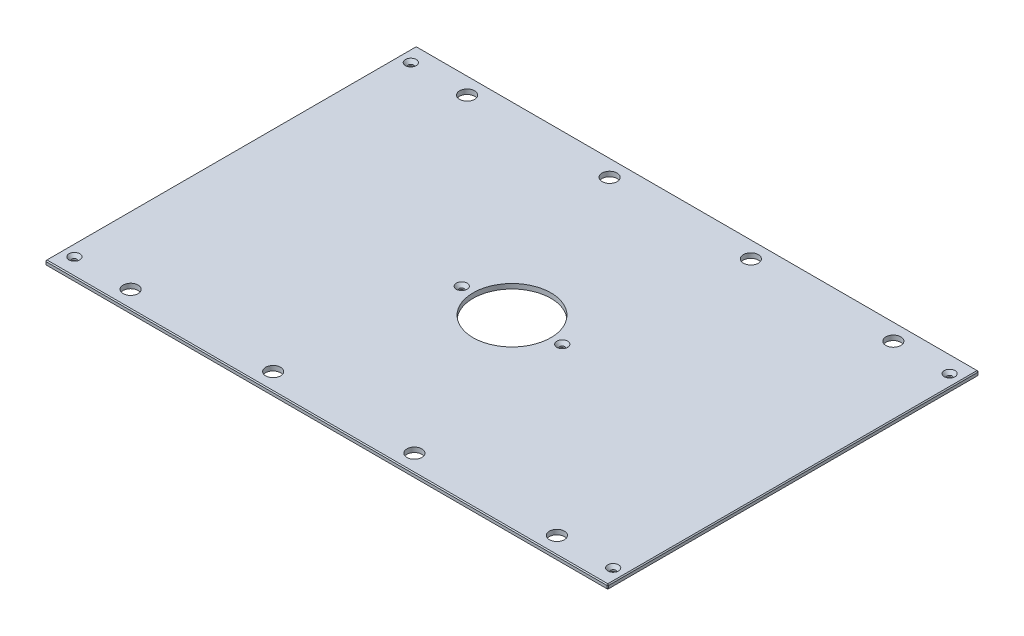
ISO-10303-21;
HEADER;
FILE_DESCRIPTION(('STEP AP214'),'2;1');
FILE_NAME('part.step','',(''),(''),'','','');
FILE_SCHEMA(('AUTOMOTIVE_DESIGN { 1 0 10303 214 1 1 1 1 }'));
ENDSEC;
DATA;
#1=APPLICATION_CONTEXT('core data for automotive mechanical design processes');
#2=APPLICATION_PROTOCOL_DEFINITION('international standard','automotive_design',2000,#1);
#3=PRODUCT_CONTEXT('',#1,'mechanical');
#4=PRODUCT('Part','Part','',(#3));
#5=PRODUCT_RELATED_PRODUCT_CATEGORY('part','',(#4));
#6=PRODUCT_DEFINITION_FORMATION('','',#4);
#7=PRODUCT_DEFINITION_CONTEXT('part definition',#1,'design');
#8=PRODUCT_DEFINITION('design','',#6,#7);
#9=PRODUCT_DEFINITION_SHAPE('','',#8);
#10=(LENGTH_UNIT() NAMED_UNIT(*) SI_UNIT(.MILLI.,.METRE.));
#11=(NAMED_UNIT(*) PLANE_ANGLE_UNIT() SI_UNIT($,.RADIAN.));
#12=(NAMED_UNIT(*) SI_UNIT($,.STERADIAN.) SOLID_ANGLE_UNIT());
#13=UNCERTAINTY_MEASURE_WITH_UNIT(LENGTH_MEASURE(1.E-05),#10,'distance_accuracy_value','');
#14=(GEOMETRIC_REPRESENTATION_CONTEXT(3) GLOBAL_UNCERTAINTY_ASSIGNED_CONTEXT((#13)) GLOBAL_UNIT_ASSIGNED_CONTEXT((#10,
#11,#12)) REPRESENTATION_CONTEXT('',''));
#15=CARTESIAN_POINT('',(0.,0.,0.));
#16=DIRECTION('',(0.,0.,1.));
#17=DIRECTION('',(1.,0.,0.));
#18=AXIS2_PLACEMENT_3D('',#15,#16,#17);
#19=CARTESIAN_POINT('',(-373.0625,6.35,-246.0625));
#20=DIRECTION('',(1.,0.,0.));
#21=DIRECTION('',(0.,0.,-1.));
#22=AXIS2_PLACEMENT_3D('',#19,#20,#21);
#23=PLANE('',#22);
#24=DIRECTION('',(0.,0.,-1.));
#25=VECTOR('',#24,1.);
#26=CARTESIAN_POINT('',(-373.0625,5.08000000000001,-246.0625));
#27=LINE('',#26,#25);
#28=CARTESIAN_POINT('',(-373.0625,5.08000000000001,244.7925));
#29=VERTEX_POINT('',#28);
#30=CARTESIAN_POINT('',(-373.0625,5.08000000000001,-244.7925));
#31=VERTEX_POINT('',#30);
#32=EDGE_CURVE('E135',#29,#31,#27,.T.);
#33=ORIENTED_EDGE('',*,*,#32,.T.);
#34=DIRECTION('',(0.,-1.,0.));
#35=VECTOR('',#34,1.);
#36=CARTESIAN_POINT('',(-373.0625,6.35,-244.7925));
#37=LINE('',#36,#35);
#38=CARTESIAN_POINT('',(-373.0625,1.26999999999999,-244.7925));
#39=VERTEX_POINT('',#38);
#40=EDGE_CURVE('E131',#31,#39,#37,.T.);
#41=ORIENTED_EDGE('',*,*,#40,.T.);
#42=DIRECTION('',(0.,0.,1.));
#43=VECTOR('',#42,1.);
#44=CARTESIAN_POINT('',(-373.0625,1.26999999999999,-246.0625));
#45=LINE('',#44,#43);
#46=CARTESIAN_POINT('',(-373.0625,1.26999999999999,244.7925));
#47=VERTEX_POINT('',#46);
#48=EDGE_CURVE('E126',#39,#47,#45,.T.);
#49=ORIENTED_EDGE('',*,*,#48,.T.);
#50=DIRECTION('',(0.,1.,0.));
#51=VECTOR('',#50,1.);
#52=CARTESIAN_POINT('',(-373.0625,6.35,244.7925));
#53=LINE('',#52,#51);
#54=EDGE_CURVE('E128',#47,#29,#53,.T.);
#55=ORIENTED_EDGE('',*,*,#54,.T.);
#56=EDGE_LOOP('',(#33,#41,#49,#55));
#57=FACE_BOUND('',#56,.T.);
#58=ADVANCED_FACE('F35',(#57),#23,.F.);
#59=CARTESIAN_POINT('',(-373.0625,6.35,246.0625));
#60=DIRECTION('',(0.,0.,-1.));
#61=DIRECTION('',(-1.,0.,0.));
#62=AXIS2_PLACEMENT_3D('',#59,#60,#61);
#63=PLANE('',#62);
#64=DIRECTION('',(1.,0.,0.));
#65=VECTOR('',#64,1.);
#66=CARTESIAN_POINT('',(-373.0625,1.26999999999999,246.0625));
#67=LINE('',#66,#65);
#68=CARTESIAN_POINT('',(-371.7925,1.26999999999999,246.0625));
#69=VERTEX_POINT('',#68);
#70=CARTESIAN_POINT('',(371.7925,1.26999999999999,246.0625));
#71=VERTEX_POINT('',#70);
#72=EDGE_CURVE('E58',#69,#71,#67,.T.);
#73=ORIENTED_EDGE('',*,*,#72,.T.);
#74=DIRECTION('',(0.,1.,0.));
#75=VECTOR('',#74,1.);
#76=CARTESIAN_POINT('',(371.7925,6.35,246.0625));
#77=LINE('',#76,#75);
#78=CARTESIAN_POINT('',(371.7925,5.08000000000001,246.0625));
#79=VERTEX_POINT('',#78);
#80=EDGE_CURVE('E11',#71,#79,#77,.T.);
#81=ORIENTED_EDGE('',*,*,#80,.T.);
#82=DIRECTION('',(-1.,0.,0.));
#83=VECTOR('',#82,1.);
#84=CARTESIAN_POINT('',(-373.0625,5.08000000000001,246.0625));
#85=LINE('',#84,#83);
#86=CARTESIAN_POINT('',(-371.7925,5.08000000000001,246.0625));
#87=VERTEX_POINT('',#86);
#88=EDGE_CURVE('E44',#79,#87,#85,.T.);
#89=ORIENTED_EDGE('',*,*,#88,.T.);
#90=DIRECTION('',(0.,-1.,0.));
#91=VECTOR('',#90,1.);
#92=CARTESIAN_POINT('',(-371.7925,6.35,246.0625));
#93=LINE('',#92,#91);
#94=EDGE_CURVE('E303',#87,#69,#93,.T.);
#95=ORIENTED_EDGE('',*,*,#94,.T.);
#96=EDGE_LOOP('',(#73,#81,#89,#95));
#97=FACE_BOUND('',#96,.T.);
#98=ADVANCED_FACE('F372',(#97),#63,.F.);
#99=CARTESIAN_POINT('',(373.0625,6.35,-246.0625));
#100=DIRECTION('',(-1.,0.,0.));
#101=DIRECTION('',(0.,0.,1.));
#102=AXIS2_PLACEMENT_3D('',#99,#100,#101);
#103=PLANE('',#102);
#104=DIRECTION('',(0.,0.,-1.));
#105=VECTOR('',#104,1.);
#106=CARTESIAN_POINT('',(373.0625,1.26999999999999,-246.0625));
#107=LINE('',#106,#105);
#108=CARTESIAN_POINT('',(373.0625,1.26999999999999,244.7925));
#109=VERTEX_POINT('',#108);
#110=CARTESIAN_POINT('',(373.0625,1.26999999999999,-244.7925));
#111=VERTEX_POINT('',#110);
#112=EDGE_CURVE('E298',#109,#111,#107,.T.);
#113=ORIENTED_EDGE('',*,*,#112,.T.);
#114=DIRECTION('',(0.,1.,0.));
#115=VECTOR('',#114,1.);
#116=CARTESIAN_POINT('',(373.0625,6.35,-244.7925));
#117=LINE('',#116,#115);
#118=CARTESIAN_POINT('',(373.0625,5.08000000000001,-244.7925));
#119=VERTEX_POINT('',#118);
#120=EDGE_CURVE('E300',#111,#119,#117,.T.);
#121=ORIENTED_EDGE('',*,*,#120,.T.);
#122=DIRECTION('',(0.,0.,1.));
#123=VECTOR('',#122,1.);
#124=CARTESIAN_POINT('',(373.0625,5.08000000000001,246.0625));
#125=LINE('',#124,#123);
#126=CARTESIAN_POINT('',(373.0625,5.08000000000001,244.7925));
#127=VERTEX_POINT('',#126);
#128=EDGE_CURVE('E296',#119,#127,#125,.T.);
#129=ORIENTED_EDGE('',*,*,#128,.T.);
#130=DIRECTION('',(0.,-1.,0.));
#131=VECTOR('',#130,1.);
#132=CARTESIAN_POINT('',(373.0625,6.35,244.7925));
#133=LINE('',#132,#131);
#134=EDGE_CURVE('E294',#127,#109,#133,.T.);
#135=ORIENTED_EDGE('',*,*,#134,.T.);
#136=EDGE_LOOP('',(#113,#121,#129,#135));
#137=FACE_BOUND('',#136,.T.);
#138=ADVANCED_FACE('F359',(#137),#103,.F.);
#139=CARTESIAN_POINT('',(-373.0625,6.35,-246.0625));
#140=DIRECTION('',(0.,0.,1.));
#141=DIRECTION('',(1.,0.,0.));
#142=AXIS2_PLACEMENT_3D('',#139,#140,#141);
#143=PLANE('',#142);
#144=DIRECTION('',(-1.,0.,0.));
#145=VECTOR('',#144,1.);
#146=CARTESIAN_POINT('',(-373.0625,1.26999999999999,-246.0625));
#147=LINE('',#146,#145);
#148=CARTESIAN_POINT('',(371.7925,1.26999999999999,-246.0625));
#149=VERTEX_POINT('',#148);
#150=CARTESIAN_POINT('',(-371.7925,1.26999999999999,-246.0625));
#151=VERTEX_POINT('',#150);
#152=EDGE_CURVE('E270',#149,#151,#147,.T.);
#153=ORIENTED_EDGE('',*,*,#152,.T.);
#154=DIRECTION('',(0.,1.,0.));
#155=VECTOR('',#154,1.);
#156=CARTESIAN_POINT('',(-371.7925,6.35,-246.0625));
#157=LINE('',#156,#155);
#158=CARTESIAN_POINT('',(-371.7925,5.08000000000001,-246.0625));
#159=VERTEX_POINT('',#158);
#160=EDGE_CURVE('E274',#151,#159,#157,.T.);
#161=ORIENTED_EDGE('',*,*,#160,.T.);
#162=DIRECTION('',(1.,0.,0.));
#163=VECTOR('',#162,1.);
#164=CARTESIAN_POINT('',(373.0625,5.08000000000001,-246.0625));
#165=LINE('',#164,#163);
#166=CARTESIAN_POINT('',(371.7925,5.08000000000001,-246.0625));
#167=VERTEX_POINT('',#166);
#168=EDGE_CURVE('E272',#159,#167,#165,.T.);
#169=ORIENTED_EDGE('',*,*,#168,.T.);
#170=DIRECTION('',(0.,-1.,0.));
#171=VECTOR('',#170,1.);
#172=CARTESIAN_POINT('',(371.7925,6.35,-246.0625));
#173=LINE('',#172,#171);
#174=EDGE_CURVE('E268',#167,#149,#173,.T.);
#175=ORIENTED_EDGE('',*,*,#174,.T.);
#176=EDGE_LOOP('',(#153,#161,#169,#175));
#177=FACE_BOUND('',#176,.T.);
#178=ADVANCED_FACE('F333',(#177),#143,.F.);
#179=CARTESIAN_POINT('',(0.,6.35,0.));
#180=DIRECTION('',(0.,1.,0.));
#181=DIRECTION('',(0.,0.,1.));
#182=AXIS2_PLACEMENT_3D('',#179,#180,#181);
#183=PLANE('',#182);
#184=CARTESIAN_POINT('',(357.1875,6.35,-223.04248));
#185=DIRECTION('',(0.,1.,0.));
#186=DIRECTION('',(0.,0.,1.));
#187=AXIS2_PLACEMENT_3D('',#184,#185,#186);
#188=CIRCLE('',#187,7.13740000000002);
#189=CARTESIAN_POINT('',(357.1875,6.35,-215.90508));
#190=VERTEX_POINT('',#189);
#191=EDGE_CURVE('E816',#190,#190,#188,.T.);
#192=ORIENTED_EDGE('',*,*,#191,.F.);
#193=EDGE_LOOP('',(#192));
#194=FACE_BOUND('',#193,.T.);
#195=CARTESIAN_POINT('',(357.1875,6.35,223.04248));
#196=DIRECTION('',(0.,1.,0.));
#197=DIRECTION('',(0.,0.,1.));
#198=AXIS2_PLACEMENT_3D('',#195,#196,#197);
#199=CIRCLE('',#198,7.13740000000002);
#200=CARTESIAN_POINT('',(357.1875,6.35,230.17988));
#201=VERTEX_POINT('',#200);
#202=EDGE_CURVE('E820',#201,#201,#199,.T.);
#203=ORIENTED_EDGE('',*,*,#202,.F.);
#204=EDGE_LOOP('',(#203));
#205=FACE_BOUND('',#204,.T.);
#206=CARTESIAN_POINT('',(-357.1875,6.35,223.04248));
#207=DIRECTION('',(0.,1.,0.));
#208=DIRECTION('',(0.,0.,1.));
#209=AXIS2_PLACEMENT_3D('',#206,#207,#208);
#210=CIRCLE('',#209,7.13740000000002);
#211=CARTESIAN_POINT('',(-357.1875,6.35,230.17988));
#212=VERTEX_POINT('',#211);
#213=EDGE_CURVE('E824',#212,#212,#210,.T.);
#214=ORIENTED_EDGE('',*,*,#213,.F.);
#215=EDGE_LOOP('',(#214));
#216=FACE_BOUND('',#215,.T.);
#217=CARTESIAN_POINT('',(-66.675,6.35,0.));
#218=DIRECTION('',(0.,1.,0.));
#219=DIRECTION('',(0.,0.,1.));
#220=AXIS2_PLACEMENT_3D('',#217,#218,#219);
#221=CIRCLE('',#220,7.1374);
#222=CARTESIAN_POINT('',(-66.675,6.35,7.1374));
#223=VERTEX_POINT('',#222);
#224=EDGE_CURVE('E828',#223,#223,#221,.T.);
#225=ORIENTED_EDGE('',*,*,#224,.F.);
#226=EDGE_LOOP('',(#225));
#227=FACE_BOUND('',#226,.T.);
#228=CARTESIAN_POINT('',(66.675,6.35,0.));
#229=DIRECTION('',(0.,1.,0.));
#230=DIRECTION('',(0.,0.,1.));
#231=AXIS2_PLACEMENT_3D('',#228,#229,#230);
#232=CIRCLE('',#231,7.1374);
#233=CARTESIAN_POINT('',(66.675,6.35,7.1374));
#234=VERTEX_POINT('',#233);
#235=EDGE_CURVE('E832',#234,#234,#232,.T.);
#236=ORIENTED_EDGE('',*,*,#235,.F.);
#237=EDGE_LOOP('',(#236));
#238=FACE_BOUND('',#237,.T.);
#239=CARTESIAN_POINT('',(-357.1875,6.35,-223.04248));
#240=DIRECTION('',(0.,1.,0.));
#241=DIRECTION('',(0.,0.,1.));
#242=AXIS2_PLACEMENT_3D('',#239,#240,#241);
#243=CIRCLE('',#242,7.13740000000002);
#244=CARTESIAN_POINT('',(-357.1875,6.35,-215.90508));
#245=VERTEX_POINT('',#244);
#246=EDGE_CURVE('E835',#245,#245,#243,.T.);
#247=ORIENTED_EDGE('',*,*,#246,.F.);
#248=EDGE_LOOP('',(#247));
#249=FACE_BOUND('',#248,.T.);
#250=DIRECTION('',(0.,0.,-1.));
#251=VECTOR('',#250,1.);
#252=CARTESIAN_POINT('',(371.7925,6.35,-246.0625));
#253=LINE('',#252,#251);
#254=CARTESIAN_POINT('',(371.7925,6.35,244.7925));
#255=VERTEX_POINT('',#254);
#256=CARTESIAN_POINT('',(371.7925,6.35,-244.7925));
#257=VERTEX_POINT('',#256);
#258=EDGE_CURVE('E281',#255,#257,#253,.T.);
#259=ORIENTED_EDGE('',*,*,#258,.T.);
#260=DIRECTION('',(-1.,0.,0.));
#261=VECTOR('',#260,1.);
#262=CARTESIAN_POINT('',(-373.0625,6.35,-244.7925));
#263=LINE('',#262,#261);
#264=CARTESIAN_POINT('',(-371.7925,6.35,-244.7925));
#265=VERTEX_POINT('',#264);
#266=EDGE_CURVE('E283',#257,#265,#263,.T.);
#267=ORIENTED_EDGE('',*,*,#266,.T.);
#268=DIRECTION('',(0.,0.,1.));
#269=VECTOR('',#268,1.);
#270=CARTESIAN_POINT('',(-371.7925,6.35,246.0625));
#271=LINE('',#270,#269);
#272=CARTESIAN_POINT('',(-371.7925,6.35,244.7925));
#273=VERTEX_POINT('',#272);
#274=EDGE_CURVE('E279',#265,#273,#271,.T.);
#275=ORIENTED_EDGE('',*,*,#274,.T.);
#276=DIRECTION('',(1.,0.,0.));
#277=VECTOR('',#276,1.);
#278=CARTESIAN_POINT('',(373.0625,6.35,244.7925));
#279=LINE('',#278,#277);
#280=EDGE_CURVE('E277',#273,#255,#279,.T.);
#281=ORIENTED_EDGE('',*,*,#280,.T.);
#282=EDGE_LOOP('',(#259,#267,#275,#281));
#283=FACE_BOUND('',#282,.T.);
#284=CARTESIAN_POINT('',(282.575,6.35,-223.04248));
#285=DIRECTION('',(0.,1.,0.));
#286=DIRECTION('',(0.,0.,1.));
#287=AXIS2_PLACEMENT_3D('',#284,#285,#286);
#288=CIRCLE('',#287,9.92187500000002);
#289=CARTESIAN_POINT('',(282.575,6.35,-213.120605));
#290=VERTEX_POINT('',#289);
#291=EDGE_CURVE('E204',#290,#290,#288,.T.);
#292=ORIENTED_EDGE('',*,*,#291,.F.);
#293=EDGE_LOOP('',(#292));
#294=FACE_BOUND('',#293,.T.);
#295=CARTESIAN_POINT('',(-282.575,6.35,-223.04248));
#296=DIRECTION('',(0.,1.,0.));
#297=DIRECTION('',(0.,0.,1.));
#298=AXIS2_PLACEMENT_3D('',#295,#296,#297);
#299=CIRCLE('',#298,9.92187500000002);
#300=CARTESIAN_POINT('',(-282.575,6.35,-213.120605));
#301=VERTEX_POINT('',#300);
#302=EDGE_CURVE('E214',#301,#301,#299,.T.);
#303=ORIENTED_EDGE('',*,*,#302,.F.);
#304=EDGE_LOOP('',(#303));
#305=FACE_BOUND('',#304,.T.);
#306=CARTESIAN_POINT('',(282.575,6.35,223.04248));
#307=DIRECTION('',(0.,1.,0.));
#308=DIRECTION('',(0.,0.,1.));
#309=AXIS2_PLACEMENT_3D('',#306,#307,#308);
#310=CIRCLE('',#309,9.92187500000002);
#311=CARTESIAN_POINT('',(282.575,6.35,232.964355));
#312=VERTEX_POINT('',#311);
#313=EDGE_CURVE('E225',#312,#312,#310,.T.);
#314=ORIENTED_EDGE('',*,*,#313,.F.);
#315=EDGE_LOOP('',(#314));
#316=FACE_BOUND('',#315,.T.);
#317=CARTESIAN_POINT('',(-282.575,6.35,223.04248));
#318=DIRECTION('',(0.,1.,0.));
#319=DIRECTION('',(0.,0.,1.));
#320=AXIS2_PLACEMENT_3D('',#317,#318,#319);
#321=CIRCLE('',#320,9.92187500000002);
#322=CARTESIAN_POINT('',(-282.575,6.35,232.964355));
#323=VERTEX_POINT('',#322);
#324=EDGE_CURVE('E231',#323,#323,#321,.T.);
#325=ORIENTED_EDGE('',*,*,#324,.F.);
#326=EDGE_LOOP('',(#325));
#327=FACE_BOUND('',#326,.T.);
#328=CARTESIAN_POINT('',(-93.6625,6.35,-223.04248));
#329=DIRECTION('',(0.,1.,0.));
#330=DIRECTION('',(0.,0.,1.));
#331=AXIS2_PLACEMENT_3D('',#328,#329,#330);
#332=CIRCLE('',#331,9.921875);
#333=CARTESIAN_POINT('',(-93.6625,6.35,-213.120605));
#334=VERTEX_POINT('',#333);
#335=EDGE_CURVE('E237',#334,#334,#332,.T.);
#336=ORIENTED_EDGE('',*,*,#335,.F.);
#337=EDGE_LOOP('',(#336));
#338=FACE_BOUND('',#337,.T.);
#339=CARTESIAN_POINT('',(93.6625,6.35,-223.04248));
#340=DIRECTION('',(0.,1.,0.));
#341=DIRECTION('',(0.,0.,1.));
#342=AXIS2_PLACEMENT_3D('',#339,#340,#341);
#343=CIRCLE('',#342,9.921875);
#344=CARTESIAN_POINT('',(93.6625,6.35,-213.120605));
#345=VERTEX_POINT('',#344);
#346=EDGE_CURVE('E243',#345,#345,#343,.T.);
#347=ORIENTED_EDGE('',*,*,#346,.F.);
#348=EDGE_LOOP('',(#347));
#349=FACE_BOUND('',#348,.T.);
#350=CARTESIAN_POINT('',(93.6625,6.35,223.04248));
#351=DIRECTION('',(0.,1.,0.));
#352=DIRECTION('',(0.,0.,1.));
#353=AXIS2_PLACEMENT_3D('',#350,#351,#352);
#354=CIRCLE('',#353,9.921875);
#355=CARTESIAN_POINT('',(93.6625,6.35,232.964355));
#356=VERTEX_POINT('',#355);
#357=EDGE_CURVE('E249',#356,#356,#354,.T.);
#358=ORIENTED_EDGE('',*,*,#357,.F.);
#359=EDGE_LOOP('',(#358));
#360=FACE_BOUND('',#359,.T.);
#361=CARTESIAN_POINT('',(-93.6625,6.35,223.04248));
#362=DIRECTION('',(0.,1.,0.));
#363=DIRECTION('',(0.,0.,1.));
#364=AXIS2_PLACEMENT_3D('',#361,#362,#363);
#365=CIRCLE('',#364,9.921875);
#366=CARTESIAN_POINT('',(-93.6625,6.35,232.964355));
#367=VERTEX_POINT('',#366);
#368=EDGE_CURVE('E255',#367,#367,#365,.T.);
#369=ORIENTED_EDGE('',*,*,#368,.F.);
#370=EDGE_LOOP('',(#369));
#371=FACE_BOUND('',#370,.T.);
#372=CARTESIAN_POINT('',(0.,6.35,0.));
#373=DIRECTION('',(0.,1.,0.));
#374=DIRECTION('',(0.,0.,1.));
#375=AXIS2_PLACEMENT_3D('',#372,#373,#374);
#376=CIRCLE('',#375,51.562);
#377=CARTESIAN_POINT('',(0.,6.35,51.562));
#378=VERTEX_POINT('',#377);
#379=EDGE_CURVE('E261',#378,#378,#376,.T.);
#380=ORIENTED_EDGE('',*,*,#379,.F.);
#381=EDGE_LOOP('',(#380));
#382=FACE_BOUND('',#381,.T.);
#383=ADVANCED_FACE('F381',(#194,#205,#216,#227,#238,#249,#283,#294,#305,#316,#327,#338,#349,
#360,#371,#382),#183,.T.);
#384=CARTESIAN_POINT('',(0.,0.,0.));
#385=DIRECTION('',(0.,1.,0.));
#386=DIRECTION('',(0.,0.,1.));
#387=AXIS2_PLACEMENT_3D('',#384,#385,#386);
#388=PLANE('',#387);
#389=CARTESIAN_POINT('',(357.1875,0.,-223.04248));
#390=DIRECTION('',(0.,1.,0.));
#391=DIRECTION('',(0.,0.,1.));
#392=AXIS2_PLACEMENT_3D('',#389,#390,#391);
#393=CIRCLE('',#392,3.3782);
#394=CARTESIAN_POINT('',(357.1875,0.,-219.66428));
#395=VERTEX_POINT('',#394);
#396=EDGE_CURVE('E869',#395,#395,#393,.T.);
#397=ORIENTED_EDGE('',*,*,#396,.T.);
#398=EDGE_LOOP('',(#397));
#399=FACE_BOUND('',#398,.T.);
#400=CARTESIAN_POINT('',(357.1875,0.,223.04248));
#401=DIRECTION('',(0.,1.,0.));
#402=DIRECTION('',(0.,0.,1.));
#403=AXIS2_PLACEMENT_3D('',#400,#401,#402);
#404=CIRCLE('',#403,3.3782);
#405=CARTESIAN_POINT('',(357.1875,0.,226.42068));
#406=VERTEX_POINT('',#405);
#407=EDGE_CURVE('E862',#406,#406,#404,.T.);
#408=ORIENTED_EDGE('',*,*,#407,.T.);
#409=EDGE_LOOP('',(#408));
#410=FACE_BOUND('',#409,.T.);
#411=CARTESIAN_POINT('',(-357.1875,0.,223.04248));
#412=DIRECTION('',(0.,1.,0.));
#413=DIRECTION('',(0.,0.,1.));
#414=AXIS2_PLACEMENT_3D('',#411,#412,#413);
#415=CIRCLE('',#414,3.3782);
#416=CARTESIAN_POINT('',(-357.1875,0.,226.42068));
#417=VERTEX_POINT('',#416);
#418=EDGE_CURVE('E855',#417,#417,#415,.T.);
#419=ORIENTED_EDGE('',*,*,#418,.T.);
#420=EDGE_LOOP('',(#419));
#421=FACE_BOUND('',#420,.T.);
#422=CARTESIAN_POINT('',(-66.675,0.,0.));
#423=DIRECTION('',(0.,1.,0.));
#424=DIRECTION('',(0.,0.,1.));
#425=AXIS2_PLACEMENT_3D('',#422,#423,#424);
#426=CIRCLE('',#425,3.3782);
#427=CARTESIAN_POINT('',(-66.675,0.,3.3782));
#428=VERTEX_POINT('',#427);
#429=EDGE_CURVE('E848',#428,#428,#426,.T.);
#430=ORIENTED_EDGE('',*,*,#429,.T.);
#431=EDGE_LOOP('',(#430));
#432=FACE_BOUND('',#431,.T.);
#433=CARTESIAN_POINT('',(66.675,0.,0.));
#434=DIRECTION('',(0.,1.,0.));
#435=DIRECTION('',(0.,0.,1.));
#436=AXIS2_PLACEMENT_3D('',#433,#434,#435);
#437=CIRCLE('',#436,3.3782);
#438=CARTESIAN_POINT('',(66.675,0.,3.3782));
#439=VERTEX_POINT('',#438);
#440=EDGE_CURVE('E838',#439,#439,#437,.T.);
#441=ORIENTED_EDGE('',*,*,#440,.T.);
#442=EDGE_LOOP('',(#441));
#443=FACE_BOUND('',#442,.T.);
#444=CARTESIAN_POINT('',(-357.1875,0.,-223.04248));
#445=DIRECTION('',(0.,1.,0.));
#446=DIRECTION('',(0.,0.,1.));
#447=AXIS2_PLACEMENT_3D('',#444,#445,#446);
#448=CIRCLE('',#447,3.3782);
#449=CARTESIAN_POINT('',(-357.1875,0.,-219.66428));
#450=VERTEX_POINT('',#449);
#451=EDGE_CURVE('E217',#450,#450,#448,.T.);
#452=ORIENTED_EDGE('',*,*,#451,.T.);
#453=EDGE_LOOP('',(#452));
#454=FACE_BOUND('',#453,.T.);
#455=DIRECTION('',(0.,0.,-1.));
#456=VECTOR('',#455,1.);
#457=CARTESIAN_POINT('',(-371.7925,0.,0.));
#458=LINE('',#457,#456);
#459=CARTESIAN_POINT('',(-371.7925,0.,244.7925));
#460=VERTEX_POINT('',#459);
#461=CARTESIAN_POINT('',(-371.7925,0.,-244.7925));
#462=VERTEX_POINT('',#461);
#463=EDGE_CURVE('E158',#460,#462,#458,.T.);
#464=ORIENTED_EDGE('',*,*,#463,.T.);
#465=DIRECTION('',(1.,0.,0.));
#466=VECTOR('',#465,1.);
#467=CARTESIAN_POINT('',(0.,0.,-244.7925));
#468=LINE('',#467,#466);
#469=CARTESIAN_POINT('',(371.7925,0.,-244.7925));
#470=VERTEX_POINT('',#469);
#471=EDGE_CURVE('E291',#462,#470,#468,.T.);
#472=ORIENTED_EDGE('',*,*,#471,.T.);
#473=DIRECTION('',(0.,0.,1.));
#474=VECTOR('',#473,1.);
#475=CARTESIAN_POINT('',(371.7925,0.,0.));
#476=LINE('',#475,#474);
#477=CARTESIAN_POINT('',(371.7925,0.,244.7925));
#478=VERTEX_POINT('',#477);
#479=EDGE_CURVE('E289',#470,#478,#476,.T.);
#480=ORIENTED_EDGE('',*,*,#479,.T.);
#481=DIRECTION('',(-1.,0.,0.));
#482=VECTOR('',#481,1.);
#483=CARTESIAN_POINT('',(0.,0.,244.7925));
#484=LINE('',#483,#482);
#485=EDGE_CURVE('E286',#478,#460,#484,.T.);
#486=ORIENTED_EDGE('',*,*,#485,.T.);
#487=EDGE_LOOP('',(#464,#472,#480,#486));
#488=FACE_BOUND('',#487,.T.);
#489=CARTESIAN_POINT('',(282.575,0.,-223.04248));
#490=DIRECTION('',(0.,1.,0.));
#491=DIRECTION('',(0.,0.,1.));
#492=AXIS2_PLACEMENT_3D('',#489,#490,#491);
#493=CIRCLE('',#492,9.92187500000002);
#494=CARTESIAN_POINT('',(282.575,0.,-213.120605));
#495=VERTEX_POINT('',#494);
#496=EDGE_CURVE('E209',#495,#495,#493,.T.);
#497=ORIENTED_EDGE('',*,*,#496,.T.);
#498=EDGE_LOOP('',(#497));
#499=FACE_BOUND('',#498,.T.);
#500=CARTESIAN_POINT('',(-282.575,0.,-223.04248));
#501=DIRECTION('',(0.,1.,0.));
#502=DIRECTION('',(0.,0.,1.));
#503=AXIS2_PLACEMENT_3D('',#500,#501,#502);
#504=CIRCLE('',#503,9.92187500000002);
#505=CARTESIAN_POINT('',(-282.575,0.,-213.120605));
#506=VERTEX_POINT('',#505);
#507=EDGE_CURVE('E222',#506,#506,#504,.T.);
#508=ORIENTED_EDGE('',*,*,#507,.T.);
#509=EDGE_LOOP('',(#508));
#510=FACE_BOUND('',#509,.T.);
#511=CARTESIAN_POINT('',(282.575,0.,223.04248));
#512=DIRECTION('',(0.,1.,0.));
#513=DIRECTION('',(0.,0.,1.));
#514=AXIS2_PLACEMENT_3D('',#511,#512,#513);
#515=CIRCLE('',#514,9.92187500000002);
#516=CARTESIAN_POINT('',(282.575,0.,232.964355));
#517=VERTEX_POINT('',#516);
#518=EDGE_CURVE('E228',#517,#517,#515,.T.);
#519=ORIENTED_EDGE('',*,*,#518,.T.);
#520=EDGE_LOOP('',(#519));
#521=FACE_BOUND('',#520,.T.);
#522=CARTESIAN_POINT('',(-282.575,0.,223.04248));
#523=DIRECTION('',(0.,1.,0.));
#524=DIRECTION('',(0.,0.,1.));
#525=AXIS2_PLACEMENT_3D('',#522,#523,#524);
#526=CIRCLE('',#525,9.92187500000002);
#527=CARTESIAN_POINT('',(-282.575,0.,232.964355));
#528=VERTEX_POINT('',#527);
#529=EDGE_CURVE('E234',#528,#528,#526,.T.);
#530=ORIENTED_EDGE('',*,*,#529,.T.);
#531=EDGE_LOOP('',(#530));
#532=FACE_BOUND('',#531,.T.);
#533=CARTESIAN_POINT('',(-93.6625,0.,-223.04248));
#534=DIRECTION('',(0.,1.,0.));
#535=DIRECTION('',(0.,0.,1.));
#536=AXIS2_PLACEMENT_3D('',#533,#534,#535);
#537=CIRCLE('',#536,9.921875);
#538=CARTESIAN_POINT('',(-93.6625,0.,-213.120605));
#539=VERTEX_POINT('',#538);
#540=EDGE_CURVE('E240',#539,#539,#537,.T.);
#541=ORIENTED_EDGE('',*,*,#540,.T.);
#542=EDGE_LOOP('',(#541));
#543=FACE_BOUND('',#542,.T.);
#544=CARTESIAN_POINT('',(93.6625,0.,-223.04248));
#545=DIRECTION('',(0.,1.,0.));
#546=DIRECTION('',(0.,0.,1.));
#547=AXIS2_PLACEMENT_3D('',#544,#545,#546);
#548=CIRCLE('',#547,9.921875);
#549=CARTESIAN_POINT('',(93.6625,0.,-213.120605));
#550=VERTEX_POINT('',#549);
#551=EDGE_CURVE('E246',#550,#550,#548,.T.);
#552=ORIENTED_EDGE('',*,*,#551,.T.);
#553=EDGE_LOOP('',(#552));
#554=FACE_BOUND('',#553,.T.);
#555=CARTESIAN_POINT('',(93.6625,0.,223.04248));
#556=DIRECTION('',(0.,1.,0.));
#557=DIRECTION('',(0.,0.,1.));
#558=AXIS2_PLACEMENT_3D('',#555,#556,#557);
#559=CIRCLE('',#558,9.921875);
#560=CARTESIAN_POINT('',(93.6625,0.,232.964355));
#561=VERTEX_POINT('',#560);
#562=EDGE_CURVE('E252',#561,#561,#559,.T.);
#563=ORIENTED_EDGE('',*,*,#562,.T.);
#564=EDGE_LOOP('',(#563));
#565=FACE_BOUND('',#564,.T.);
#566=CARTESIAN_POINT('',(-93.6625,0.,223.04248));
#567=DIRECTION('',(0.,1.,0.));
#568=DIRECTION('',(0.,0.,1.));
#569=AXIS2_PLACEMENT_3D('',#566,#567,#568);
#570=CIRCLE('',#569,9.921875);
#571=CARTESIAN_POINT('',(-93.6625,0.,232.964355));
#572=VERTEX_POINT('',#571);
#573=EDGE_CURVE('E258',#572,#572,#570,.T.);
#574=ORIENTED_EDGE('',*,*,#573,.T.);
#575=EDGE_LOOP('',(#574));
#576=FACE_BOUND('',#575,.T.);
#577=CARTESIAN_POINT('',(0.,0.,0.));
#578=DIRECTION('',(0.,1.,0.));
#579=DIRECTION('',(0.,0.,1.));
#580=AXIS2_PLACEMENT_3D('',#577,#578,#579);
#581=CIRCLE('',#580,51.562);
#582=CARTESIAN_POINT('',(0.,0.,51.562));
#583=VERTEX_POINT('',#582);
#584=EDGE_CURVE('E147',#583,#583,#581,.T.);
#585=ORIENTED_EDGE('',*,*,#584,.T.);
#586=EDGE_LOOP('',(#585));
#587=FACE_BOUND('',#586,.T.);
#588=ADVANCED_FACE('F346',(#399,#410,#421,#432,#443,#454,#488,#499,#510,#521,#532,#543,#554,
#565,#576,#587),#388,.F.);
#589=CARTESIAN_POINT('',(0.,0.,0.));
#590=DIRECTION('',(0.,1.,0.));
#591=DIRECTION('',(0.,0.,1.));
#592=AXIS2_PLACEMENT_3D('',#589,#590,#591);
#593=CYLINDRICAL_SURFACE('',#592,51.562);
#594=ORIENTED_EDGE('',*,*,#584,.F.);
#595=EDGE_LOOP('',(#594));
#596=FACE_BOUND('',#595,.T.);
#597=ORIENTED_EDGE('',*,*,#379,.T.);
#598=EDGE_LOOP('',(#597));
#599=FACE_BOUND('',#598,.T.);
#600=ADVANCED_FACE('F751',(#596,#599),#593,.F.);
#601=CARTESIAN_POINT('',(-93.6625,6.35,223.04248));
#602=DIRECTION('',(0.,1.,0.));
#603=DIRECTION('',(0.,0.,1.));
#604=AXIS2_PLACEMENT_3D('',#601,#602,#603);
#605=CYLINDRICAL_SURFACE('',#604,9.921875);
#606=ORIENTED_EDGE('',*,*,#573,.F.);
#607=EDGE_LOOP('',(#606));
#608=FACE_BOUND('',#607,.T.);
#609=ORIENTED_EDGE('',*,*,#368,.T.);
#610=EDGE_LOOP('',(#609));
#611=FACE_BOUND('',#610,.T.);
#612=ADVANCED_FACE('F742',(#608,#611),#605,.F.);
#613=CARTESIAN_POINT('',(93.6625,6.35,223.04248));
#614=DIRECTION('',(0.,1.,0.));
#615=DIRECTION('',(0.,0.,1.));
#616=AXIS2_PLACEMENT_3D('',#613,#614,#615);
#617=CYLINDRICAL_SURFACE('',#616,9.921875);
#618=ORIENTED_EDGE('',*,*,#562,.F.);
#619=EDGE_LOOP('',(#618));
#620=FACE_BOUND('',#619,.T.);
#621=ORIENTED_EDGE('',*,*,#357,.T.);
#622=EDGE_LOOP('',(#621));
#623=FACE_BOUND('',#622,.T.);
#624=ADVANCED_FACE('F733',(#620,#623),#617,.F.);
#625=CARTESIAN_POINT('',(93.6625,6.35,-223.04248));
#626=DIRECTION('',(0.,1.,0.));
#627=DIRECTION('',(0.,0.,1.));
#628=AXIS2_PLACEMENT_3D('',#625,#626,#627);
#629=CYLINDRICAL_SURFACE('',#628,9.921875);
#630=ORIENTED_EDGE('',*,*,#551,.F.);
#631=EDGE_LOOP('',(#630));
#632=FACE_BOUND('',#631,.T.);
#633=ORIENTED_EDGE('',*,*,#346,.T.);
#634=EDGE_LOOP('',(#633));
#635=FACE_BOUND('',#634,.T.);
#636=ADVANCED_FACE('F724',(#632,#635),#629,.F.);
#637=CARTESIAN_POINT('',(-93.6625,6.35,-223.04248));
#638=DIRECTION('',(0.,1.,0.));
#639=DIRECTION('',(0.,0.,1.));
#640=AXIS2_PLACEMENT_3D('',#637,#638,#639);
#641=CYLINDRICAL_SURFACE('',#640,9.921875);
#642=ORIENTED_EDGE('',*,*,#540,.F.);
#643=EDGE_LOOP('',(#642));
#644=FACE_BOUND('',#643,.T.);
#645=ORIENTED_EDGE('',*,*,#335,.T.);
#646=EDGE_LOOP('',(#645));
#647=FACE_BOUND('',#646,.T.);
#648=ADVANCED_FACE('F715',(#644,#647),#641,.F.);
#649=CARTESIAN_POINT('',(-282.575,6.35,223.04248));
#650=DIRECTION('',(0.,1.,0.));
#651=DIRECTION('',(0.,0.,1.));
#652=AXIS2_PLACEMENT_3D('',#649,#650,#651);
#653=CYLINDRICAL_SURFACE('',#652,9.92187500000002);
#654=ORIENTED_EDGE('',*,*,#529,.F.);
#655=EDGE_LOOP('',(#654));
#656=FACE_BOUND('',#655,.T.);
#657=ORIENTED_EDGE('',*,*,#324,.T.);
#658=EDGE_LOOP('',(#657));
#659=FACE_BOUND('',#658,.T.);
#660=ADVANCED_FACE('F706',(#656,#659),#653,.F.);
#661=CARTESIAN_POINT('',(282.575,6.35,223.04248));
#662=DIRECTION('',(0.,1.,0.));
#663=DIRECTION('',(0.,0.,1.));
#664=AXIS2_PLACEMENT_3D('',#661,#662,#663);
#665=CYLINDRICAL_SURFACE('',#664,9.92187500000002);
#666=ORIENTED_EDGE('',*,*,#518,.F.);
#667=EDGE_LOOP('',(#666));
#668=FACE_BOUND('',#667,.T.);
#669=ORIENTED_EDGE('',*,*,#313,.T.);
#670=EDGE_LOOP('',(#669));
#671=FACE_BOUND('',#670,.T.);
#672=ADVANCED_FACE('F697',(#668,#671),#665,.F.);
#673=CARTESIAN_POINT('',(-282.575,6.35,-223.04248));
#674=DIRECTION('',(0.,1.,0.));
#675=DIRECTION('',(0.,0.,1.));
#676=AXIS2_PLACEMENT_3D('',#673,#674,#675);
#677=CYLINDRICAL_SURFACE('',#676,9.92187500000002);
#678=ORIENTED_EDGE('',*,*,#507,.F.);
#679=EDGE_LOOP('',(#678));
#680=FACE_BOUND('',#679,.T.);
#681=ORIENTED_EDGE('',*,*,#302,.T.);
#682=EDGE_LOOP('',(#681));
#683=FACE_BOUND('',#682,.T.);
#684=ADVANCED_FACE('F687',(#680,#683),#677,.F.);
#685=CARTESIAN_POINT('',(282.575,6.35,-223.04248));
#686=DIRECTION('',(0.,1.,0.));
#687=DIRECTION('',(0.,0.,1.));
#688=AXIS2_PLACEMENT_3D('',#685,#686,#687);
#689=CYLINDRICAL_SURFACE('',#688,9.92187500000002);
#690=ORIENTED_EDGE('',*,*,#496,.F.);
#691=EDGE_LOOP('',(#690));
#692=FACE_BOUND('',#691,.T.);
#693=ORIENTED_EDGE('',*,*,#291,.T.);
#694=EDGE_LOOP('',(#693));
#695=FACE_BOUND('',#694,.T.);
#696=ADVANCED_FACE('F390',(#692,#695),#689,.F.);
#697=CARTESIAN_POINT('',(373.0625,6.35,244.7925));
#698=DIRECTION('',(-0.707106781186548,0.,-0.707106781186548));
#699=DIRECTION('',(0.,-1.,0.));
#700=AXIS2_PLACEMENT_3D('',#697,#698,#699);
#701=PLANE('',#700);
#702=DIRECTION('',(-0.707106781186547,0.,0.707106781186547));
#703=VECTOR('',#702,1.);
#704=CARTESIAN_POINT('',(373.0625,5.08000000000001,244.7925));
#705=LINE('',#704,#703);
#706=EDGE_CURVE('E39',#79,#127,#705,.F.);
#707=ORIENTED_EDGE('',*,*,#706,.F.);
#708=ORIENTED_EDGE('',*,*,#80,.F.);
#709=DIRECTION('',(0.707106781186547,0.,-0.707106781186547));
#710=VECTOR('',#709,1.);
#711=CARTESIAN_POINT('',(372.4275,1.26999999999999,245.4275));
#712=LINE('',#711,#710);
#713=EDGE_CURVE('E197',#109,#71,#712,.F.);
#714=ORIENTED_EDGE('',*,*,#713,.F.);
#715=ORIENTED_EDGE('',*,*,#134,.F.);
#716=EDGE_LOOP('',(#707,#708,#714,#715));
#717=FACE_BOUND('',#716,.T.);
#718=ADVANCED_FACE('F37',(#717),#701,.F.);
#719=CARTESIAN_POINT('',(373.0625,5.08000000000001,244.7925));
#720=DIRECTION('',(0.577350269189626,0.577350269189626,0.577350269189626));
#721=DIRECTION('',(0.707106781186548,0.,-0.707106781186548));
#722=AXIS2_PLACEMENT_3D('',#719,#720,#721);
#723=PLANE('',#722);
#724=DIRECTION('',(0.,-0.707106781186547,0.707106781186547));
#725=VECTOR('',#724,1.);
#726=CARTESIAN_POINT('',(371.7925,5.715,245.4275));
#727=LINE('',#726,#725);
#728=EDGE_CURVE('E193',#79,#255,#727,.F.);
#729=ORIENTED_EDGE('',*,*,#728,.F.);
#730=ORIENTED_EDGE('',*,*,#706,.T.);
#731=DIRECTION('',(-0.707106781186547,0.707106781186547,0.));
#732=VECTOR('',#731,1.);
#733=CARTESIAN_POINT('',(373.0625,5.08000000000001,244.7925));
#734=LINE('',#733,#732);
#735=EDGE_CURVE('E195',#255,#127,#734,.F.);
#736=ORIENTED_EDGE('',*,*,#735,.F.);
#737=EDGE_LOOP('',(#729,#730,#736));
#738=FACE_BOUND('',#737,.T.);
#739=ADVANCED_FACE('F383',(#738),#723,.T.);
#740=CARTESIAN_POINT('',(371.7925,0.,244.7925));
#741=DIRECTION('',(0.577350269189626,-0.577350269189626,0.577350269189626));
#742=DIRECTION('',(0.707106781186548,0.,-0.707106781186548));
#743=AXIS2_PLACEMENT_3D('',#740,#741,#742);
#744=PLANE('',#743);
#745=DIRECTION('',(-0.707106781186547,-0.707106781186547,0.));
#746=VECTOR('',#745,1.);
#747=CARTESIAN_POINT('',(371.7925,0.,244.7925));
#748=LINE('',#747,#746);
#749=EDGE_CURVE('E187',#109,#478,#748,.T.);
#750=ORIENTED_EDGE('',*,*,#749,.F.);
#751=ORIENTED_EDGE('',*,*,#713,.T.);
#752=DIRECTION('',(0.,0.707106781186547,0.707106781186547));
#753=VECTOR('',#752,1.);
#754=CARTESIAN_POINT('',(371.7925,0.,244.7925));
#755=LINE('',#754,#753);
#756=EDGE_CURVE('E190',#478,#71,#755,.T.);
#757=ORIENTED_EDGE('',*,*,#756,.F.);
#758=EDGE_LOOP('',(#750,#751,#757));
#759=FACE_BOUND('',#758,.T.);
#760=ADVANCED_FACE('F352',(#759),#744,.T.);
#761=CARTESIAN_POINT('',(371.7925,6.35,0.));
#762=DIRECTION('',(0.707106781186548,0.707106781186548,0.));
#763=DIRECTION('',(0.,0.,1.));
#764=AXIS2_PLACEMENT_3D('',#761,#762,#763);
#765=PLANE('',#764);
#766=ORIENTED_EDGE('',*,*,#735,.T.);
#767=ORIENTED_EDGE('',*,*,#128,.F.);
#768=DIRECTION('',(0.707106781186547,-0.707106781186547,0.));
#769=VECTOR('',#768,1.);
#770=CARTESIAN_POINT('',(372.4275,5.715,-244.7925));
#771=LINE('',#770,#769);
#772=EDGE_CURVE('E182',#257,#119,#771,.T.);
#773=ORIENTED_EDGE('',*,*,#772,.F.);
#774=ORIENTED_EDGE('',*,*,#258,.F.);
#775=EDGE_LOOP('',(#766,#767,#773,#774));
#776=FACE_BOUND('',#775,.T.);
#777=ADVANCED_FACE('F369',(#776),#765,.T.);
#778=CARTESIAN_POINT('',(0.,6.35,244.7925));
#779=DIRECTION('',(0.,0.707106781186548,0.707106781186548));
#780=DIRECTION('',(-1.,0.,0.));
#781=AXIS2_PLACEMENT_3D('',#778,#779,#780);
#782=PLANE('',#781);
#783=ORIENTED_EDGE('',*,*,#728,.T.);
#784=ORIENTED_EDGE('',*,*,#280,.F.);
#785=DIRECTION('',(0.,0.707106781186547,-0.707106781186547));
#786=VECTOR('',#785,1.);
#787=CARTESIAN_POINT('',(-371.7925,6.35,244.7925));
#788=LINE('',#787,#786);
#789=EDGE_CURVE('E179',#87,#273,#788,.T.);
#790=ORIENTED_EDGE('',*,*,#789,.F.);
#791=ORIENTED_EDGE('',*,*,#88,.F.);
#792=EDGE_LOOP('',(#783,#784,#790,#791));
#793=FACE_BOUND('',#792,.T.);
#794=ADVANCED_FACE('F374',(#793),#782,.T.);
#795=CARTESIAN_POINT('',(-371.7925,6.35,246.0625));
#796=DIRECTION('',(0.707106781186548,0.,-0.707106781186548));
#797=DIRECTION('',(0.,-1.,0.));
#798=AXIS2_PLACEMENT_3D('',#795,#796,#797);
#799=PLANE('',#798);
#800=DIRECTION('',(0.707106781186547,0.,0.707106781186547));
#801=VECTOR('',#800,1.);
#802=CARTESIAN_POINT('',(-373.0625,1.26999999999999,244.7925));
#803=LINE('',#802,#801);
#804=EDGE_CURVE('E142',#69,#47,#803,.F.);
#805=ORIENTED_EDGE('',*,*,#804,.F.);
#806=ORIENTED_EDGE('',*,*,#94,.F.);
#807=DIRECTION('',(-0.707106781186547,0.,-0.707106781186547));
#808=VECTOR('',#807,1.);
#809=CARTESIAN_POINT('',(-372.4275,5.08000000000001,245.4275));
#810=LINE('',#809,#808);
#811=EDGE_CURVE('E145',#29,#87,#810,.F.);
#812=ORIENTED_EDGE('',*,*,#811,.F.);
#813=ORIENTED_EDGE('',*,*,#54,.F.);
#814=EDGE_LOOP('',(#805,#806,#812,#813));
#815=FACE_BOUND('',#814,.T.);
#816=ADVANCED_FACE('F140',(#815),#799,.F.);
#817=CARTESIAN_POINT('',(-373.0625,1.26999999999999,246.0625));
#818=DIRECTION('',(0.,0.707106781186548,-0.707106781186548));
#819=DIRECTION('',(1.,0.,0.));
#820=AXIS2_PLACEMENT_3D('',#817,#818,#819);
#821=PLANE('',#820);
#822=ORIENTED_EDGE('',*,*,#756,.T.);
#823=ORIENTED_EDGE('',*,*,#72,.F.);
#824=DIRECTION('',(0.,-0.707106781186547,-0.707106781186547));
#825=VECTOR('',#824,1.);
#826=CARTESIAN_POINT('',(-371.7925,0.634999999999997,245.4275));
#827=LINE('',#826,#825);
#828=EDGE_CURVE('E155',#460,#69,#827,.F.);
#829=ORIENTED_EDGE('',*,*,#828,.F.);
#830=ORIENTED_EDGE('',*,*,#485,.F.);
#831=EDGE_LOOP('',(#822,#823,#829,#830));
#832=FACE_BOUND('',#831,.T.);
#833=ADVANCED_FACE('F351',(#832),#821,.F.);
#834=CARTESIAN_POINT('',(373.0625,1.26999999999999,-246.0625));
#835=DIRECTION('',(-0.707106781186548,0.707106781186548,0.));
#836=DIRECTION('',(0.,0.,-1.));
#837=AXIS2_PLACEMENT_3D('',#834,#835,#836);
#838=PLANE('',#837);
#839=ORIENTED_EDGE('',*,*,#749,.T.);
#840=ORIENTED_EDGE('',*,*,#479,.F.);
#841=DIRECTION('',(0.707106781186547,0.707106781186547,0.));
#842=VECTOR('',#841,1.);
#843=CARTESIAN_POINT('',(371.7925,0.,-244.7925));
#844=LINE('',#843,#842);
#845=EDGE_CURVE('E174',#111,#470,#844,.F.);
#846=ORIENTED_EDGE('',*,*,#845,.F.);
#847=ORIENTED_EDGE('',*,*,#112,.F.);
#848=EDGE_LOOP('',(#839,#840,#846,#847));
#849=FACE_BOUND('',#848,.T.);
#850=ADVANCED_FACE('F356',(#849),#838,.F.);
#851=CARTESIAN_POINT('',(371.7925,6.35,-246.0625));
#852=DIRECTION('',(-0.707106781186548,0.,0.707106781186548));
#853=DIRECTION('',(0.,-1.,0.));
#854=AXIS2_PLACEMENT_3D('',#851,#852,#853);
#855=PLANE('',#854);
#856=DIRECTION('',(0.707106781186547,0.,0.707106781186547));
#857=VECTOR('',#856,1.);
#858=CARTESIAN_POINT('',(371.7925,5.08000000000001,-246.0625));
#859=LINE('',#858,#857);
#860=EDGE_CURVE('E184',#119,#167,#859,.F.);
#861=ORIENTED_EDGE('',*,*,#860,.F.);
#862=ORIENTED_EDGE('',*,*,#120,.F.);
#863=DIRECTION('',(-0.707106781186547,0.,-0.707106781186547));
#864=VECTOR('',#863,1.);
#865=CARTESIAN_POINT('',(372.4275,1.26999999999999,-245.4275));
#866=LINE('',#865,#864);
#867=EDGE_CURVE('E171',#149,#111,#866,.F.);
#868=ORIENTED_EDGE('',*,*,#867,.F.);
#869=ORIENTED_EDGE('',*,*,#174,.F.);
#870=EDGE_LOOP('',(#861,#862,#868,#869));
#871=FACE_BOUND('',#870,.T.);
#872=ADVANCED_FACE('F364',(#871),#855,.F.);
#873=CARTESIAN_POINT('',(371.7925,5.08000000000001,-246.0625));
#874=DIRECTION('',(0.577350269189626,0.577350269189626,-0.577350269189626));
#875=DIRECTION('',(-0.707106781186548,0.,-0.707106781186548));
#876=AXIS2_PLACEMENT_3D('',#873,#874,#875);
#877=PLANE('',#876);
#878=ORIENTED_EDGE('',*,*,#772,.T.);
#879=ORIENTED_EDGE('',*,*,#860,.T.);
#880=DIRECTION('',(0.,0.707106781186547,0.707106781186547));
#881=VECTOR('',#880,1.);
#882=CARTESIAN_POINT('',(371.7925,5.08000000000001,-246.0625));
#883=LINE('',#882,#881);
#884=EDGE_CURVE('E163',#257,#167,#883,.F.);
#885=ORIENTED_EDGE('',*,*,#884,.F.);
#886=EDGE_LOOP('',(#878,#879,#885));
#887=FACE_BOUND('',#886,.T.);
#888=ADVANCED_FACE('F422',(#887),#877,.T.);
#889=CARTESIAN_POINT('',(-371.7925,6.35,244.7925));
#890=DIRECTION('',(-0.577350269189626,0.577350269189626,0.577350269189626));
#891=DIRECTION('',(0.707106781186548,0.,0.707106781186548));
#892=AXIS2_PLACEMENT_3D('',#889,#890,#891);
#893=PLANE('',#892);
#894=ORIENTED_EDGE('',*,*,#811,.T.);
#895=ORIENTED_EDGE('',*,*,#789,.T.);
#896=DIRECTION('',(-0.707106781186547,-0.707106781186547,0.));
#897=VECTOR('',#896,1.);
#898=CARTESIAN_POINT('',(-371.7925,6.35,244.7925));
#899=LINE('',#898,#897);
#900=EDGE_CURVE('E159',#29,#273,#899,.F.);
#901=ORIENTED_EDGE('',*,*,#900,.F.);
#902=EDGE_LOOP('',(#894,#895,#901));
#903=FACE_BOUND('',#902,.T.);
#904=ADVANCED_FACE('F376',(#903),#893,.T.);
#905=CARTESIAN_POINT('',(-373.0625,1.26999999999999,244.7925));
#906=DIRECTION('',(-0.577350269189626,-0.577350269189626,0.577350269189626));
#907=DIRECTION('',(0.707106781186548,0.,0.707106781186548));
#908=AXIS2_PLACEMENT_3D('',#905,#906,#907);
#909=PLANE('',#908);
#910=ORIENTED_EDGE('',*,*,#828,.T.);
#911=ORIENTED_EDGE('',*,*,#804,.T.);
#912=DIRECTION('',(-0.707106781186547,0.707106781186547,0.));
#913=VECTOR('',#912,1.);
#914=CARTESIAN_POINT('',(-373.0625,1.26999999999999,244.7925));
#915=LINE('',#914,#913);
#916=EDGE_CURVE('E152',#460,#47,#915,.T.);
#917=ORIENTED_EDGE('',*,*,#916,.F.);
#918=EDGE_LOOP('',(#910,#911,#917));
#919=FACE_BOUND('',#918,.T.);
#920=ADVANCED_FACE('F151',(#919),#909,.T.);
#921=CARTESIAN_POINT('',(371.7925,0.,-244.7925));
#922=DIRECTION('',(0.577350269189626,-0.577350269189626,-0.577350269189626));
#923=DIRECTION('',(-0.707106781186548,0.,-0.707106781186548));
#924=AXIS2_PLACEMENT_3D('',#921,#922,#923);
#925=PLANE('',#924);
#926=ORIENTED_EDGE('',*,*,#867,.T.);
#927=ORIENTED_EDGE('',*,*,#845,.T.);
#928=DIRECTION('',(0.,-0.707106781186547,0.707106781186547));
#929=VECTOR('',#928,1.);
#930=CARTESIAN_POINT('',(371.7925,0.,-244.7925));
#931=LINE('',#930,#929);
#932=EDGE_CURVE('E160',#149,#470,#931,.T.);
#933=ORIENTED_EDGE('',*,*,#932,.F.);
#934=EDGE_LOOP('',(#926,#927,#933));
#935=FACE_BOUND('',#934,.T.);
#936=ADVANCED_FACE('F414',(#935),#925,.T.);
#937=CARTESIAN_POINT('',(0.,6.35,-244.7925));
#938=DIRECTION('',(0.,0.707106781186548,-0.707106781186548));
#939=DIRECTION('',(1.,0.,0.));
#940=AXIS2_PLACEMENT_3D('',#937,#938,#939);
#941=PLANE('',#940);
#942=ORIENTED_EDGE('',*,*,#884,.T.);
#943=ORIENTED_EDGE('',*,*,#168,.F.);
#944=DIRECTION('',(0.,-0.707106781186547,-0.707106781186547));
#945=VECTOR('',#944,1.);
#946=CARTESIAN_POINT('',(-371.7925,5.08000000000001,-246.0625));
#947=LINE('',#946,#945);
#948=EDGE_CURVE('E165',#265,#159,#947,.T.);
#949=ORIENTED_EDGE('',*,*,#948,.F.);
#950=ORIENTED_EDGE('',*,*,#266,.F.);
#951=EDGE_LOOP('',(#942,#943,#949,#950));
#952=FACE_BOUND('',#951,.T.);
#953=ADVANCED_FACE('F328',(#952),#941,.T.);
#954=CARTESIAN_POINT('',(-371.7925,6.35,0.));
#955=DIRECTION('',(-0.707106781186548,0.707106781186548,0.));
#956=DIRECTION('',(0.,0.,-1.));
#957=AXIS2_PLACEMENT_3D('',#954,#955,#956);
#958=PLANE('',#957);
#959=ORIENTED_EDGE('',*,*,#900,.T.);
#960=ORIENTED_EDGE('',*,*,#274,.F.);
#961=DIRECTION('',(0.707106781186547,0.707106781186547,0.));
#962=VECTOR('',#961,1.);
#963=CARTESIAN_POINT('',(-372.4275,5.715,-244.7925));
#964=LINE('',#963,#962);
#965=EDGE_CURVE('E317',#31,#265,#964,.T.);
#966=ORIENTED_EDGE('',*,*,#965,.F.);
#967=ORIENTED_EDGE('',*,*,#32,.F.);
#968=EDGE_LOOP('',(#959,#960,#966,#967));
#969=FACE_BOUND('',#968,.T.);
#970=ADVANCED_FACE('F379',(#969),#958,.T.);
#971=CARTESIAN_POINT('',(-373.0625,1.26999999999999,-246.0625));
#972=DIRECTION('',(0.707106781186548,0.707106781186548,0.));
#973=DIRECTION('',(0.,0.,1.));
#974=AXIS2_PLACEMENT_3D('',#971,#972,#973);
#975=PLANE('',#974);
#976=ORIENTED_EDGE('',*,*,#916,.T.);
#977=ORIENTED_EDGE('',*,*,#48,.F.);
#978=DIRECTION('',(0.707106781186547,-0.707106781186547,0.));
#979=VECTOR('',#978,1.);
#980=CARTESIAN_POINT('',(-373.0625,1.26999999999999,-244.7925));
#981=LINE('',#980,#979);
#982=EDGE_CURVE('E314',#462,#39,#981,.F.);
#983=ORIENTED_EDGE('',*,*,#982,.F.);
#984=ORIENTED_EDGE('',*,*,#463,.F.);
#985=EDGE_LOOP('',(#976,#977,#983,#984));
#986=FACE_BOUND('',#985,.T.);
#987=ADVANCED_FACE('F157',(#986),#975,.F.);
#988=CARTESIAN_POINT('',(-373.0625,1.26999999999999,-246.0625));
#989=DIRECTION('',(0.,0.707106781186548,0.707106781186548));
#990=DIRECTION('',(-1.,0.,0.));
#991=AXIS2_PLACEMENT_3D('',#988,#989,#990);
#992=PLANE('',#991);
#993=ORIENTED_EDGE('',*,*,#932,.T.);
#994=ORIENTED_EDGE('',*,*,#471,.F.);
#995=DIRECTION('',(0.,0.707106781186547,-0.707106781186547));
#996=VECTOR('',#995,1.);
#997=CARTESIAN_POINT('',(-371.7925,0.634999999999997,-245.4275));
#998=LINE('',#997,#996);
#999=EDGE_CURVE('E311',#151,#462,#998,.F.);
#1000=ORIENTED_EDGE('',*,*,#999,.F.);
#1001=ORIENTED_EDGE('',*,*,#152,.F.);
#1002=EDGE_LOOP('',(#993,#994,#1000,#1001));
#1003=FACE_BOUND('',#1002,.T.);
#1004=ADVANCED_FACE('F343',(#1003),#992,.F.);
#1005=CARTESIAN_POINT('',(-371.7925,5.08000000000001,-246.0625));
#1006=DIRECTION('',(-0.577350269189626,0.577350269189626,-0.577350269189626));
#1007=DIRECTION('',(-0.707106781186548,0.,0.707106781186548));
#1008=AXIS2_PLACEMENT_3D('',#1005,#1006,#1007);
#1009=PLANE('',#1008);
#1010=ORIENTED_EDGE('',*,*,#965,.T.);
#1011=ORIENTED_EDGE('',*,*,#948,.T.);
#1012=DIRECTION('',(0.707106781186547,0.,-0.707106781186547));
#1013=VECTOR('',#1012,1.);
#1014=CARTESIAN_POINT('',(-371.7925,5.08000000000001,-246.0625));
#1015=LINE('',#1014,#1013);
#1016=EDGE_CURVE('E309',#31,#159,#1015,.T.);
#1017=ORIENTED_EDGE('',*,*,#1016,.F.);
#1018=EDGE_LOOP('',(#1010,#1011,#1017));
#1019=FACE_BOUND('',#1018,.T.);
#1020=ADVANCED_FACE('F323',(#1019),#1009,.T.);
#1021=CARTESIAN_POINT('',(-373.0625,1.26999999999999,-244.7925));
#1022=DIRECTION('',(-0.577350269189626,-0.577350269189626,-0.577350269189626));
#1023=DIRECTION('',(-0.707106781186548,0.,0.707106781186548));
#1024=AXIS2_PLACEMENT_3D('',#1021,#1022,#1023);
#1025=PLANE('',#1024);
#1026=ORIENTED_EDGE('',*,*,#999,.T.);
#1027=ORIENTED_EDGE('',*,*,#982,.T.);
#1028=DIRECTION('',(-0.707106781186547,0.,0.707106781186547));
#1029=VECTOR('',#1028,1.);
#1030=CARTESIAN_POINT('',(-373.0625,1.26999999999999,-244.7925));
#1031=LINE('',#1030,#1029);
#1032=EDGE_CURVE('E307',#151,#39,#1031,.T.);
#1033=ORIENTED_EDGE('',*,*,#1032,.F.);
#1034=EDGE_LOOP('',(#1026,#1027,#1033));
#1035=FACE_BOUND('',#1034,.T.);
#1036=ADVANCED_FACE('F340',(#1035),#1025,.T.);
#1037=CARTESIAN_POINT('',(-373.0625,6.35,-244.7925));
#1038=DIRECTION('',(0.707106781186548,0.,0.707106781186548));
#1039=DIRECTION('',(0.,-1.,0.));
#1040=AXIS2_PLACEMENT_3D('',#1037,#1038,#1039);
#1041=PLANE('',#1040);
#1042=ORIENTED_EDGE('',*,*,#1016,.T.);
#1043=ORIENTED_EDGE('',*,*,#160,.F.);
#1044=ORIENTED_EDGE('',*,*,#1032,.T.);
#1045=ORIENTED_EDGE('',*,*,#40,.F.);
#1046=EDGE_LOOP('',(#1042,#1043,#1044,#1045));
#1047=FACE_BOUND('',#1046,.T.);
#1048=ADVANCED_FACE('F338',(#1047),#1041,.F.);
#1049=CARTESIAN_POINT('',(-357.1875,6.35,-223.04248));
#1050=DIRECTION('',(0.,1.,0.));
#1051=DIRECTION('',(0.,0.,1.));
#1052=AXIS2_PLACEMENT_3D('',#1049,#1050,#1051);
#1053=CYLINDRICAL_SURFACE('',#1052,3.3782);
#1054=ORIENTED_EDGE('',*,*,#451,.F.);
#1055=EDGE_LOOP('',(#1054));
#1056=FACE_BOUND('',#1055,.T.);
#1057=CARTESIAN_POINT('',(-357.1875,2.02553508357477,-223.04248));
#1058=DIRECTION('',(0.,1.,0.));
#1059=DIRECTION('',(0.,0.,1.));
#1060=AXIS2_PLACEMENT_3D('',#1057,#1058,#1059);
#1061=CIRCLE('',#1060,3.3782);
#1062=CARTESIAN_POINT('',(-357.1875,2.02553508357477,-219.66428));
#1063=VERTEX_POINT('',#1062);
#1064=EDGE_CURVE('E837',#1063,#1063,#1061,.T.);
#1065=ORIENTED_EDGE('',*,*,#1064,.T.);
#1066=EDGE_LOOP('',(#1065));
#1067=FACE_BOUND('',#1066,.T.);
#1068=ADVANCED_FACE('F401',(#1056,#1067),#1053,.F.);
#1069=CARTESIAN_POINT('',(-357.1875,6.35,-223.04248));
#1070=DIRECTION('',(0.,1.,0.));
#1071=DIRECTION('',(0.,0.,1.));
#1072=AXIS2_PLACEMENT_3D('',#1069,#1070,#1071);
#1073=CONICAL_SURFACE('',#1072,7.13740000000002,0.715584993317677);
#1074=ORIENTED_EDGE('',*,*,#1064,.F.);
#1075=EDGE_LOOP('',(#1074));
#1076=FACE_BOUND('',#1075,.T.);
#1077=ORIENTED_EDGE('',*,*,#246,.T.);
#1078=EDGE_LOOP('',(#1077));
#1079=FACE_BOUND('',#1078,.T.);
#1080=ADVANCED_FACE('F511',(#1076,#1079),#1073,.F.);
#1081=CARTESIAN_POINT('',(66.675,6.35,0.));
#1082=DIRECTION('',(0.,1.,0.));
#1083=DIRECTION('',(0.,0.,1.));
#1084=AXIS2_PLACEMENT_3D('',#1081,#1082,#1083);
#1085=CYLINDRICAL_SURFACE('',#1084,3.3782);
#1086=ORIENTED_EDGE('',*,*,#440,.F.);
#1087=EDGE_LOOP('',(#1086));
#1088=FACE_BOUND('',#1087,.T.);
#1089=CARTESIAN_POINT('',(66.675,2.02553508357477,0.));
#1090=DIRECTION('',(0.,1.,0.));
#1091=DIRECTION('',(0.,0.,1.));
#1092=AXIS2_PLACEMENT_3D('',#1089,#1090,#1091);
#1093=CIRCLE('',#1092,3.3782);
#1094=CARTESIAN_POINT('',(66.675,2.02553508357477,3.3782));
#1095=VERTEX_POINT('',#1094);
#1096=EDGE_CURVE('E842',#1095,#1095,#1093,.T.);
#1097=ORIENTED_EDGE('',*,*,#1096,.T.);
#1098=EDGE_LOOP('',(#1097));
#1099=FACE_BOUND('',#1098,.T.);
#1100=ADVANCED_FACE('F520',(#1088,#1099),#1085,.F.);
#1101=CARTESIAN_POINT('',(66.675,6.35,0.));
#1102=DIRECTION('',(0.,1.,0.));
#1103=DIRECTION('',(0.,0.,1.));
#1104=AXIS2_PLACEMENT_3D('',#1101,#1102,#1103);
#1105=CONICAL_SURFACE('',#1104,7.1374,0.715584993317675);
#1106=ORIENTED_EDGE('',*,*,#1096,.F.);
#1107=EDGE_LOOP('',(#1106));
#1108=FACE_BOUND('',#1107,.T.);
#1109=ORIENTED_EDGE('',*,*,#235,.T.);
#1110=EDGE_LOOP('',(#1109));
#1111=FACE_BOUND('',#1110,.T.);
#1112=ADVANCED_FACE('F528',(#1108,#1111),#1105,.F.);
#1113=CARTESIAN_POINT('',(-66.675,6.35,0.));
#1114=DIRECTION('',(0.,1.,0.));
#1115=DIRECTION('',(0.,0.,1.));
#1116=AXIS2_PLACEMENT_3D('',#1113,#1114,#1115);
#1117=CYLINDRICAL_SURFACE('',#1116,3.3782);
#1118=ORIENTED_EDGE('',*,*,#429,.F.);
#1119=EDGE_LOOP('',(#1118));
#1120=FACE_BOUND('',#1119,.T.);
#1121=CARTESIAN_POINT('',(-66.675,2.02553508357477,0.));
#1122=DIRECTION('',(0.,1.,0.));
#1123=DIRECTION('',(0.,0.,1.));
#1124=AXIS2_PLACEMENT_3D('',#1121,#1122,#1123);
#1125=CIRCLE('',#1124,3.3782);
#1126=CARTESIAN_POINT('',(-66.675,2.02553508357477,3.3782));
#1127=VERTEX_POINT('',#1126);
#1128=EDGE_CURVE('E851',#1127,#1127,#1125,.T.);
#1129=ORIENTED_EDGE('',*,*,#1128,.T.);
#1130=EDGE_LOOP('',(#1129));
#1131=FACE_BOUND('',#1130,.T.);
#1132=ADVANCED_FACE('F536',(#1120,#1131),#1117,.F.);
#1133=CARTESIAN_POINT('',(-66.675,6.35,0.));
#1134=DIRECTION('',(0.,1.,0.));
#1135=DIRECTION('',(0.,0.,1.));
#1136=AXIS2_PLACEMENT_3D('',#1133,#1134,#1135);
#1137=CONICAL_SURFACE('',#1136,7.1374,0.715584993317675);
#1138=ORIENTED_EDGE('',*,*,#1128,.F.);
#1139=EDGE_LOOP('',(#1138));
#1140=FACE_BOUND('',#1139,.T.);
#1141=ORIENTED_EDGE('',*,*,#224,.T.);
#1142=EDGE_LOOP('',(#1141));
#1143=FACE_BOUND('',#1142,.T.);
#1144=ADVANCED_FACE('F544',(#1140,#1143),#1137,.F.);
#1145=CARTESIAN_POINT('',(-357.1875,6.35,223.04248));
#1146=DIRECTION('',(0.,1.,0.));
#1147=DIRECTION('',(0.,0.,1.));
#1148=AXIS2_PLACEMENT_3D('',#1145,#1146,#1147);
#1149=CYLINDRICAL_SURFACE('',#1148,3.3782);
#1150=ORIENTED_EDGE('',*,*,#418,.F.);
#1151=EDGE_LOOP('',(#1150));
#1152=FACE_BOUND('',#1151,.T.);
#1153=CARTESIAN_POINT('',(-357.1875,2.02553508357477,223.04248));
#1154=DIRECTION('',(0.,1.,0.));
#1155=DIRECTION('',(0.,0.,1.));
#1156=AXIS2_PLACEMENT_3D('',#1153,#1154,#1155);
#1157=CIRCLE('',#1156,3.3782);
#1158=CARTESIAN_POINT('',(-357.1875,2.02553508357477,226.42068));
#1159=VERTEX_POINT('',#1158);
#1160=EDGE_CURVE('E858',#1159,#1159,#1157,.T.);
#1161=ORIENTED_EDGE('',*,*,#1160,.T.);
#1162=EDGE_LOOP('',(#1161));
#1163=FACE_BOUND('',#1162,.T.);
#1164=ADVANCED_FACE('F552',(#1152,#1163),#1149,.F.);
#1165=CARTESIAN_POINT('',(-357.1875,6.35,223.04248));
#1166=DIRECTION('',(0.,1.,0.));
#1167=DIRECTION('',(0.,0.,1.));
#1168=AXIS2_PLACEMENT_3D('',#1165,#1166,#1167);
#1169=CONICAL_SURFACE('',#1168,7.13740000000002,0.715584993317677);
#1170=ORIENTED_EDGE('',*,*,#1160,.F.);
#1171=EDGE_LOOP('',(#1170));
#1172=FACE_BOUND('',#1171,.T.);
#1173=ORIENTED_EDGE('',*,*,#213,.T.);
#1174=EDGE_LOOP('',(#1173));
#1175=FACE_BOUND('',#1174,.T.);
#1176=ADVANCED_FACE('F560',(#1172,#1175),#1169,.F.);
#1177=CARTESIAN_POINT('',(357.1875,6.35,223.04248));
#1178=DIRECTION('',(0.,1.,0.));
#1179=DIRECTION('',(0.,0.,1.));
#1180=AXIS2_PLACEMENT_3D('',#1177,#1178,#1179);
#1181=CYLINDRICAL_SURFACE('',#1180,3.3782);
#1182=ORIENTED_EDGE('',*,*,#407,.F.);
#1183=EDGE_LOOP('',(#1182));
#1184=FACE_BOUND('',#1183,.T.);
#1185=CARTESIAN_POINT('',(357.1875,2.02553508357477,223.04248));
#1186=DIRECTION('',(0.,1.,0.));
#1187=DIRECTION('',(0.,0.,1.));
#1188=AXIS2_PLACEMENT_3D('',#1185,#1186,#1187);
#1189=CIRCLE('',#1188,3.3782);
#1190=CARTESIAN_POINT('',(357.1875,2.02553508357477,226.42068));
#1191=VERTEX_POINT('',#1190);
#1192=EDGE_CURVE('E865',#1191,#1191,#1189,.T.);
#1193=ORIENTED_EDGE('',*,*,#1192,.T.);
#1194=EDGE_LOOP('',(#1193));
#1195=FACE_BOUND('',#1194,.T.);
#1196=ADVANCED_FACE('F568',(#1184,#1195),#1181,.F.);
#1197=CARTESIAN_POINT('',(357.1875,6.35,223.04248));
#1198=DIRECTION('',(0.,1.,0.));
#1199=DIRECTION('',(0.,0.,1.));
#1200=AXIS2_PLACEMENT_3D('',#1197,#1198,#1199);
#1201=CONICAL_SURFACE('',#1200,7.13740000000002,0.715584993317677);
#1202=ORIENTED_EDGE('',*,*,#1192,.F.);
#1203=EDGE_LOOP('',(#1202));
#1204=FACE_BOUND('',#1203,.T.);
#1205=ORIENTED_EDGE('',*,*,#202,.T.);
#1206=EDGE_LOOP('',(#1205));
#1207=FACE_BOUND('',#1206,.T.);
#1208=ADVANCED_FACE('F576',(#1204,#1207),#1201,.F.);
#1209=CARTESIAN_POINT('',(357.1875,6.35,-223.04248));
#1210=DIRECTION('',(0.,1.,0.));
#1211=DIRECTION('',(0.,0.,1.));
#1212=AXIS2_PLACEMENT_3D('',#1209,#1210,#1211);
#1213=CYLINDRICAL_SURFACE('',#1212,3.3782);
#1214=ORIENTED_EDGE('',*,*,#396,.F.);
#1215=EDGE_LOOP('',(#1214));
#1216=FACE_BOUND('',#1215,.T.);
#1217=CARTESIAN_POINT('',(357.1875,2.02553508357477,-223.04248));
#1218=DIRECTION('',(0.,1.,0.));
#1219=DIRECTION('',(0.,0.,1.));
#1220=AXIS2_PLACEMENT_3D('',#1217,#1218,#1219);
#1221=CIRCLE('',#1220,3.3782);
#1222=CARTESIAN_POINT('',(357.1875,2.02553508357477,-219.66428));
#1223=VERTEX_POINT('',#1222);
#1224=EDGE_CURVE('E872',#1223,#1223,#1221,.T.);
#1225=ORIENTED_EDGE('',*,*,#1224,.T.);
#1226=EDGE_LOOP('',(#1225));
#1227=FACE_BOUND('',#1226,.T.);
#1228=ADVANCED_FACE('F584',(#1216,#1227),#1213,.F.);
#1229=CARTESIAN_POINT('',(357.1875,6.35,-223.04248));
#1230=DIRECTION('',(0.,1.,0.));
#1231=DIRECTION('',(0.,0.,1.));
#1232=AXIS2_PLACEMENT_3D('',#1229,#1230,#1231);
#1233=CONICAL_SURFACE('',#1232,7.13740000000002,0.715584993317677);
#1234=ORIENTED_EDGE('',*,*,#1224,.F.);
#1235=EDGE_LOOP('',(#1234));
#1236=FACE_BOUND('',#1235,.T.);
#1237=ORIENTED_EDGE('',*,*,#191,.T.);
#1238=EDGE_LOOP('',(#1237));
#1239=FACE_BOUND('',#1238,.T.);
#1240=ADVANCED_FACE('F592',(#1236,#1239),#1233,.F.);
#1241=CLOSED_SHELL('',(#58,#98,#138,#178,#383,#588,#600,#612,#624,#636,#648,#660,#672,#684,#696,
#718,#739,#760,#777,#794,#816,#833,#850,#872,#888,#904,#920,#936,#953,#970,#987,#1004,#1020,
#1036,#1048,#1068,#1080,#1100,#1112,#1132,#1144,#1164,#1176,#1196,#1208,#1228,#1240));
#1242=MANIFOLD_SOLID_BREP('B2',#1241);
#1243=ADVANCED_BREP_SHAPE_REPRESENTATION('',(#18,#1242),#14);
#1244=SHAPE_DEFINITION_REPRESENTATION(#9,#1243);
ENDSEC;
END-ISO-10303-21;
